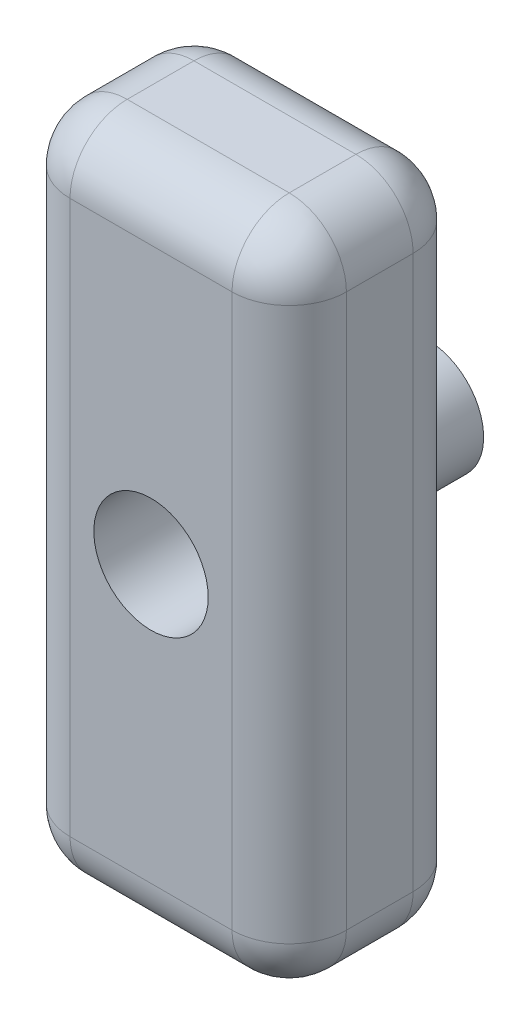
from build123d import *

# Parameters (mm, degrees)
EXTRUDE_1_DEPTH     = 19
SKETCH_8_R          = 5.9
EXTRUDE_2_DEPTH     = 10
FILLET_2_R          = 6
SKETCH_9_R          = 6
CUT_EXTRUDE_1_DEPTH = 15


with BuildPart() as part:
    # Sketch 2 → Extrude 1 (new body)
    with BuildSketch(Plane.XY):
        Polygon((24.5, 54.5), (10, 54.5), (-4.5, 54.5), (-4.5, -15.5), (24.5, -15.5), align=None)
    extrude(amount=EXTRUDE_1_DEPTH)

    # Sketch 8 → Extrude 2 (add)
    with BuildSketch(Plane(origin=(0, 0, 0), x_dir=(-1, 0, 0), z_dir=(0, 0, -1))):
        with Locations((-10, 19.5)):
            Circle(SKETCH_8_R)
    extrude(amount=EXTRUDE_2_DEPTH)

    # Fillet 2
    fillet_2_edges = [part.edges().sort_by_distance(p)[0] for p in [
        (10, 54.5, 19),
        (-4.5, 19.5, 19),
        (10, -15.5, 19),
        (-4.5, 19.5, 0),
        (10, 54.5, 0),
        (24.5, 19.5, 0),
        (10, -15.5, 0),
        (24.5, 19.5, 19),
        (-4.5, -15.5, 9.5),
        (-4.5, 54.5, 9.5),
        (24.5, 54.5, 9.5),
        (24.5, -15.5, 9.5),
    ]]
    fillet(fillet_2_edges, radius=FILLET_2_R)

    # Sketch 9 → Cut-Extrude 1 (cut)
    with BuildSketch(Plane.XY.offset(19)):
        with Locations((10, 19.5)):
            Circle(SKETCH_9_R)
    extrude(amount=-CUT_EXTRUDE_1_DEPTH, mode=Mode.SUBTRACT)


solid = part.part
